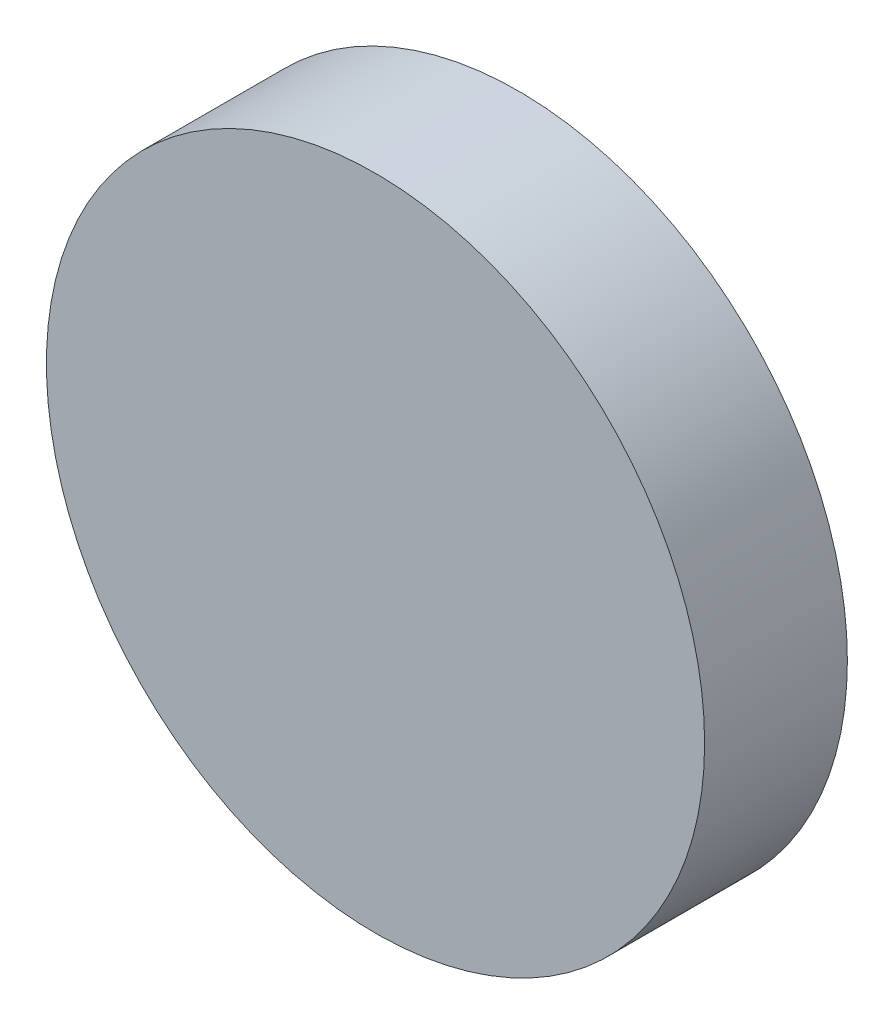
ISO-10303-21;
HEADER;
FILE_DESCRIPTION(('STEP AP214'),'2;1');
FILE_NAME('part.step','',(''),(''),'','','');
FILE_SCHEMA(('AUTOMOTIVE_DESIGN { 1 0 10303 214 1 1 1 1 }'));
ENDSEC;
DATA;
#1=APPLICATION_CONTEXT('core data for automotive mechanical design processes');
#2=APPLICATION_PROTOCOL_DEFINITION('international standard','automotive_design',2000,#1);
#3=PRODUCT_CONTEXT('',#1,'mechanical');
#4=PRODUCT('Part','Part','',(#3));
#5=PRODUCT_RELATED_PRODUCT_CATEGORY('part','',(#4));
#6=PRODUCT_DEFINITION_FORMATION('','',#4);
#7=PRODUCT_DEFINITION_CONTEXT('part definition',#1,'design');
#8=PRODUCT_DEFINITION('design','',#6,#7);
#9=PRODUCT_DEFINITION_SHAPE('','',#8);
#10=(LENGTH_UNIT() NAMED_UNIT(*) SI_UNIT(.MILLI.,.METRE.));
#11=(NAMED_UNIT(*) PLANE_ANGLE_UNIT() SI_UNIT($,.RADIAN.));
#12=(NAMED_UNIT(*) SI_UNIT($,.STERADIAN.) SOLID_ANGLE_UNIT());
#13=UNCERTAINTY_MEASURE_WITH_UNIT(LENGTH_MEASURE(1.E-05),#10,'distance_accuracy_value','');
#14=(GEOMETRIC_REPRESENTATION_CONTEXT(3) GLOBAL_UNCERTAINTY_ASSIGNED_CONTEXT((#13)) GLOBAL_UNIT_ASSIGNED_CONTEXT((#10,
#11,#12)) REPRESENTATION_CONTEXT('',''));
#15=CARTESIAN_POINT('',(0.,0.,0.));
#16=DIRECTION('',(0.,0.,1.));
#17=DIRECTION('',(1.,0.,0.));
#18=AXIS2_PLACEMENT_3D('',#15,#16,#17);
#19=CARTESIAN_POINT('',(0.,0.,7.));
#20=DIRECTION('',(0.,0.,-1.));
#21=DIRECTION('',(-1.,0.,0.));
#22=AXIS2_PLACEMENT_3D('',#19,#20,#21);
#23=CYLINDRICAL_SURFACE('',#22,32.2742980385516);
#24=CARTESIAN_POINT('',(0.,0.,7.));
#25=DIRECTION('',(0.,0.,1.));
#26=DIRECTION('',(1.,0.,0.));
#27=AXIS2_PLACEMENT_3D('',#24,#25,#26);
#28=CIRCLE('',#27,32.2742980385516);
#29=CARTESIAN_POINT('',(32.2742980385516,0.,7.));
#30=VERTEX_POINT('',#29);
#31=EDGE_CURVE('E11',#30,#30,#28,.T.);
#32=ORIENTED_EDGE('',*,*,#31,.F.);
#33=EDGE_LOOP('',(#32));
#34=FACE_BOUND('',#33,.T.);
#35=CARTESIAN_POINT('',(0.,0.,-7.));
#36=DIRECTION('',(0.,0.,1.));
#37=DIRECTION('',(1.,0.,0.));
#38=AXIS2_PLACEMENT_3D('',#35,#36,#37);
#39=CIRCLE('',#38,32.2742980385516);
#40=CARTESIAN_POINT('',(32.2742980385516,0.,-7.));
#41=VERTEX_POINT('',#40);
#42=EDGE_CURVE('E49',#41,#41,#39,.T.);
#43=ORIENTED_EDGE('',*,*,#42,.T.);
#44=EDGE_LOOP('',(#43));
#45=FACE_BOUND('',#44,.T.);
#46=ADVANCED_FACE('F43',(#34,#45),#23,.T.);
#47=CARTESIAN_POINT('',(0.,0.,7.));
#48=DIRECTION('',(0.,0.,1.));
#49=DIRECTION('',(1.,0.,0.));
#50=AXIS2_PLACEMENT_3D('',#47,#48,#49);
#51=PLANE('',#50);
#52=ORIENTED_EDGE('',*,*,#31,.T.);
#53=EDGE_LOOP('',(#52));
#54=FACE_BOUND('',#53,.T.);
#55=ADVANCED_FACE('F58',(#54),#51,.T.);
#56=CARTESIAN_POINT('',(0.,0.,-7.));
#57=DIRECTION('',(0.,0.,1.));
#58=DIRECTION('',(1.,0.,0.));
#59=AXIS2_PLACEMENT_3D('',#56,#57,#58);
#60=PLANE('',#59);
#61=ORIENTED_EDGE('',*,*,#42,.F.);
#62=EDGE_LOOP('',(#61));
#63=FACE_BOUND('',#62,.T.);
#64=ADVANCED_FACE('F56',(#63),#60,.F.);
#65=CLOSED_SHELL('',(#46,#55,#64));
#66=MANIFOLD_SOLID_BREP('B2',#65);
#67=ADVANCED_BREP_SHAPE_REPRESENTATION('',(#18,#66),#14);
#68=SHAPE_DEFINITION_REPRESENTATION(#9,#67);
ENDSEC;
END-ISO-10303-21;
